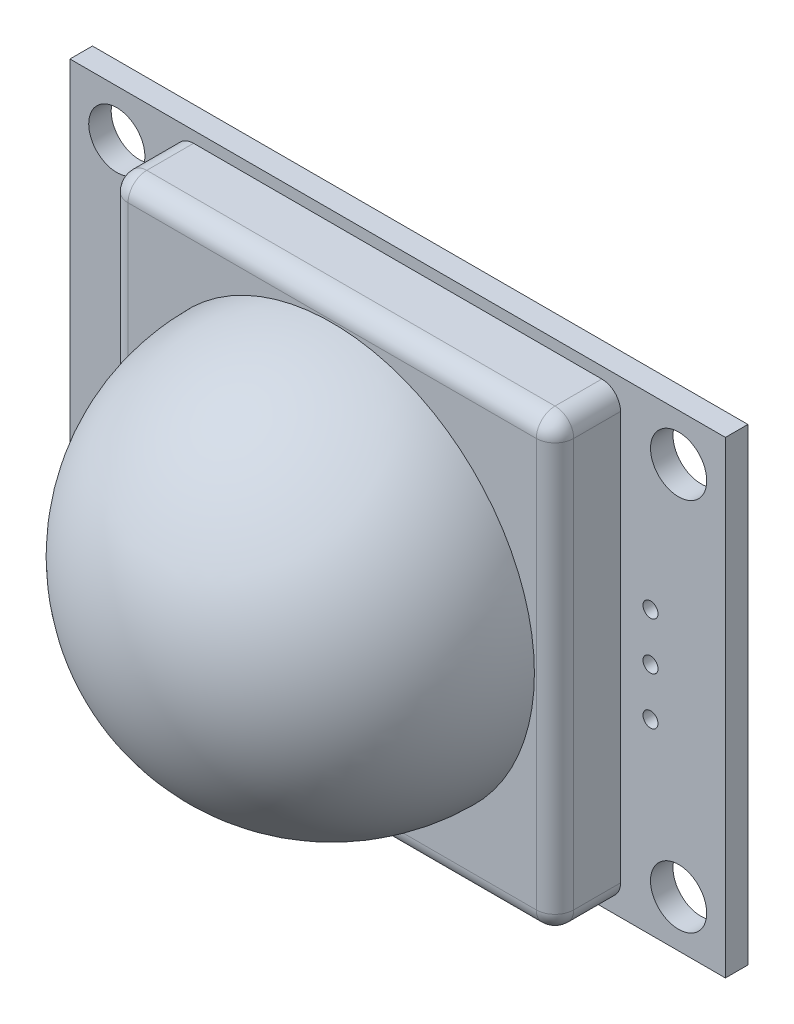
from build123d import *

# Parameters (mm, degrees)
ESQUISSE1_W      = 35
ESQUISSE1_H      = 25
ESQUISSE1_R      = 1.5
ESQUISSE1_R_2    = 0.4
EXTRUSION1_DEPTH = 1.2
EXTRUSION2_DEPTH = 3.5
CONG_1_R         = 1


with BuildPart() as part:
    # Esquisse1 → Extrusion1 (new body)
    with BuildSketch(Plane.XY):
        with Locations((17.5, 12.5)):
            Rectangle(ESQUISSE1_W, ESQUISSE1_H)
        with Locations((2.5, 2.5)):
            Circle(ESQUISSE1_R, mode=Mode.SUBTRACT)
        with Locations(Location((32.5, 2.5, 0), (0, 0, 180))):
            Circle(ESQUISSE1_R, mode=Mode.SUBTRACT)
        with Locations((32.5, 22.5)):
            Circle(ESQUISSE1_R, mode=Mode.SUBTRACT)
        with Locations(Location((2.5, 22.5, 0), (0, 0, 180))):
            Circle(ESQUISSE1_R, mode=Mode.SUBTRACT)
        with Locations((31, 12.5)):
            Circle(ESQUISSE1_R_2, mode=Mode.SUBTRACT)
        with Locations((31, 15.04)):
            Circle(ESQUISSE1_R_2, mode=Mode.SUBTRACT)
        with Locations(Location((31, 9.96, 0), (0, 0, 180))):
            Circle(ESQUISSE1_R_2, mode=Mode.SUBTRACT)
    extrude(amount=EXTRUSION1_DEPTH)

    # Esquisse2 → Extrusion2 (add)
    with BuildSketch(Plane.XY.offset(1.2)):
        with BuildLine():
            Line((6.6, 24.4), (28.4, 24.4))
            ThreePointArc((28.4, 24.4), (29.107106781, 24.107106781), (29.4, 23.4))
            Line((29.4, 23.4), (29.4, 1.6))
            ThreePointArc((29.4, 1.6), (29.107106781, 0.892893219), (28.4, 0.6))
            Line((28.4, 0.6), (6.6, 0.6))
            ThreePointArc((6.6, 0.6), (5.892893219, 0.892893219), (5.6, 1.6))
            Line((5.6, 1.6), (5.6, 23.4))
            ThreePointArc((5.6, 23.4), (5.892893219, 24.107106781), (6.6, 24.4))
        make_face()
    extrude(amount=EXTRUSION2_DEPTH)

    # Cong_1
    cong_1_edges = [part.edges().sort_by_distance(p)[0] for p in [
        (29.107106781, 24.107106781, 4.7),
        (17.5, 24.4, 4.7),
        (5.892893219, 24.107106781, 4.7),
        (5.6, 12.5, 4.7),
        (5.892893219, 0.892893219, 4.7),
        (17.5, 0.6, 4.7),
        (29.107106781, 0.892893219, 4.7),
        (29.4, 12.5, 4.7),
    ]]
    fillet(cong_1_edges, radius=CONG_1_R)

    # Esquisse3 → R_vol.-Mince1 (revolve)
    with BuildSketch(Plane(origin=(0, 12.5, 0), x_dir=(-1, 0, 0), z_dir=(0, 1, 0))):
        with BuildLine():
            ThreePointArc((-17.5, 15.5), (-25.136753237, 12.336753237), (-28.3, 4.7))
            Line((-28.3, 4.7), (-28.2999, 4.7))
            ThreePointArc((-28.2999, 4.7), (-25.136682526, 12.336682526), (-17.5, 15.4999))
            Line((-17.5, 15.4999), (-17.5, 15.5))
        make_face()
    revolve(axis=Axis((17.5, 12.5, -1.665550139), (0, 0, 1)))


solid = part.part
